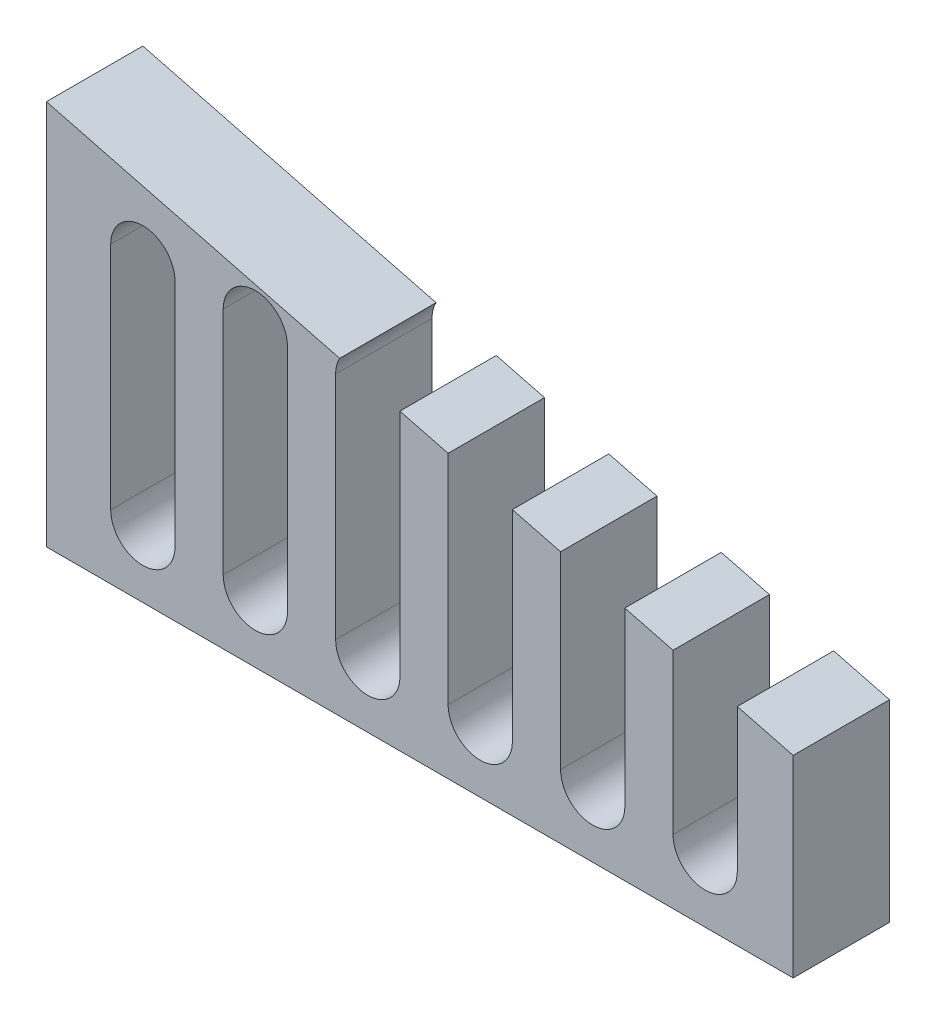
ISO-10303-21;
HEADER;
FILE_DESCRIPTION(('STEP AP214'),'2;1');
FILE_NAME('part.step','',(''),(''),'','','');
FILE_SCHEMA(('AUTOMOTIVE_DESIGN { 1 0 10303 214 1 1 1 1 }'));
ENDSEC;
DATA;
#1=APPLICATION_CONTEXT('core data for automotive mechanical design processes');
#2=APPLICATION_PROTOCOL_DEFINITION('international standard','automotive_design',2000,#1);
#3=PRODUCT_CONTEXT('',#1,'mechanical');
#4=PRODUCT('Part','Part','',(#3));
#5=PRODUCT_RELATED_PRODUCT_CATEGORY('part','',(#4));
#6=PRODUCT_DEFINITION_FORMATION('','',#4);
#7=PRODUCT_DEFINITION_CONTEXT('part definition',#1,'design');
#8=PRODUCT_DEFINITION('design','',#6,#7);
#9=PRODUCT_DEFINITION_SHAPE('','',#8);
#10=(LENGTH_UNIT() NAMED_UNIT(*) SI_UNIT(.MILLI.,.METRE.));
#11=(NAMED_UNIT(*) PLANE_ANGLE_UNIT() SI_UNIT($,.RADIAN.));
#12=(NAMED_UNIT(*) SI_UNIT($,.STERADIAN.) SOLID_ANGLE_UNIT());
#13=UNCERTAINTY_MEASURE_WITH_UNIT(LENGTH_MEASURE(1.E-05),#10,'distance_accuracy_value','');
#14=(GEOMETRIC_REPRESENTATION_CONTEXT(3) GLOBAL_UNCERTAINTY_ASSIGNED_CONTEXT((#13)) GLOBAL_UNIT_ASSIGNED_CONTEXT((#10,
#11,#12)) REPRESENTATION_CONTEXT('',''));
#15=CARTESIAN_POINT('',(0.,0.,0.));
#16=DIRECTION('',(0.,0.,1.));
#17=DIRECTION('',(1.,0.,0.));
#18=AXIS2_PLACEMENT_3D('',#15,#16,#17);
#19=CARTESIAN_POINT('',(0.,38.1,-9.525));
#20=DIRECTION('',(-0.25,-0.968245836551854,0.));
#21=DIRECTION('',(0.968245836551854,-0.25,0.));
#22=AXIS2_PLACEMENT_3D('',#19,#20,#21);
#23=PLANE('',#22);
#24=DIRECTION('',(0.968245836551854,-0.25,0.));
#25=VECTOR('',#24,1.);
#26=CARTESIAN_POINT('',(0.,38.1,-9.525));
#27=LINE('',#26,#25);
#28=CARTESIAN_POINT('',(68.2625,20.4746982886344,-9.525));
#29=VERTEX_POINT('',#28);
#30=CARTESIAN_POINT('',(73.7803327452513,19.05,-9.525));
#31=VERTEX_POINT('',#30);
#32=EDGE_CURVE('E410',#29,#31,#27,.T.);
#33=ORIENTED_EDGE('',*,*,#32,.F.);
#34=DIRECTION('',(0.,0.,1.));
#35=VECTOR('',#34,1.);
#36=CARTESIAN_POINT('',(68.2625,20.4746982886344,-9.525));
#37=LINE('',#36,#35);
#38=CARTESIAN_POINT('',(68.2625,20.4746982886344,0.));
#39=VERTEX_POINT('',#38);
#40=EDGE_CURVE('E249',#29,#39,#37,.T.);
#41=ORIENTED_EDGE('',*,*,#40,.T.);
#42=DIRECTION('',(0.968245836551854,-0.25,0.));
#43=VECTOR('',#42,1.);
#44=CARTESIAN_POINT('',(0.,38.1,0.));
#45=LINE('',#44,#43);
#46=CARTESIAN_POINT('',(73.7803327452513,19.05,0.));
#47=VERTEX_POINT('',#46);
#48=EDGE_CURVE('E398',#39,#47,#45,.T.);
#49=ORIENTED_EDGE('',*,*,#48,.T.);
#50=DIRECTION('',(0.,0.,1.));
#51=VECTOR('',#50,1.);
#52=CARTESIAN_POINT('',(73.7803327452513,19.05,-9.525));
#53=LINE('',#52,#51);
#54=EDGE_CURVE('E425',#31,#47,#53,.T.);
#55=ORIENTED_EDGE('',*,*,#54,.F.);
#56=EDGE_LOOP('',(#33,#41,#49,#55));
#57=FACE_BOUND('',#56,.T.);
#58=ADVANCED_FACE('F28',(#57),#23,.F.);
#59=CARTESIAN_POINT('',(57.15,23.3439334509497,0.));
#60=VERTEX_POINT('',#59);
#61=CARTESIAN_POINT('',(61.9125,22.1142612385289,0.));
#62=VERTEX_POINT('',#61);
#63=EDGE_CURVE('E441',#60,#62,#45,.T.);
#64=ORIENTED_EDGE('',*,*,#63,.T.);
#65=DIRECTION('',(0.,0.,-1.));
#66=VECTOR('',#65,1.);
#67=CARTESIAN_POINT('',(61.9125,22.1142612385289,-9.525));
#68=LINE('',#67,#66);
#69=CARTESIAN_POINT('',(61.9125,22.1142612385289,-9.525));
#70=VERTEX_POINT('',#69);
#71=EDGE_CURVE('E43',#62,#70,#68,.T.);
#72=ORIENTED_EDGE('',*,*,#71,.T.);
#73=CARTESIAN_POINT('',(57.15,23.3439334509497,-9.525));
#74=VERTEX_POINT('',#73);
#75=EDGE_CURVE('E239',#74,#70,#27,.T.);
#76=ORIENTED_EDGE('',*,*,#75,.F.);
#77=DIRECTION('',(0.,0.,1.));
#78=VECTOR('',#77,1.);
#79=CARTESIAN_POINT('',(57.15,23.3439334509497,-9.525));
#80=LINE('',#79,#78);
#81=EDGE_CURVE('E270',#74,#60,#80,.T.);
#82=ORIENTED_EDGE('',*,*,#81,.T.);
#83=EDGE_LOOP('',(#64,#72,#76,#82));
#84=FACE_BOUND('',#83,.T.);
#85=ADVANCED_FACE('F440',(#84),#23,.F.);
#86=CARTESIAN_POINT('',(46.0375,26.2131686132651,0.));
#87=VERTEX_POINT('',#86);
#88=CARTESIAN_POINT('',(50.8,24.9834964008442,0.));
#89=VERTEX_POINT('',#88);
#90=EDGE_CURVE('E445',#87,#89,#45,.T.);
#91=ORIENTED_EDGE('',*,*,#90,.T.);
#92=DIRECTION('',(0.,0.,-1.));
#93=VECTOR('',#92,1.);
#94=CARTESIAN_POINT('',(50.8,24.9834964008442,-9.525));
#95=LINE('',#94,#93);
#96=CARTESIAN_POINT('',(50.8,24.9834964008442,-9.525));
#97=VERTEX_POINT('',#96);
#98=EDGE_CURVE('E51',#89,#97,#95,.T.);
#99=ORIENTED_EDGE('',*,*,#98,.T.);
#100=CARTESIAN_POINT('',(46.0375,26.2131686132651,-9.525));
#101=VERTEX_POINT('',#100);
#102=EDGE_CURVE('E466',#101,#97,#27,.T.);
#103=ORIENTED_EDGE('',*,*,#102,.F.);
#104=DIRECTION('',(0.,0.,1.));
#105=VECTOR('',#104,1.);
#106=CARTESIAN_POINT('',(46.0375,26.2131686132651,-9.525));
#107=LINE('',#106,#105);
#108=EDGE_CURVE('E294',#101,#87,#107,.T.);
#109=ORIENTED_EDGE('',*,*,#108,.T.);
#110=EDGE_LOOP('',(#91,#99,#103,#109));
#111=FACE_BOUND('',#110,.T.);
#112=ADVANCED_FACE('F492',(#111),#23,.F.);
#113=CARTESIAN_POINT('',(0.,38.1,0.));
#114=VERTEX_POINT('',#113);
#115=CARTESIAN_POINT('',(28.971875,30.6194940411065,0.));
#116=VERTEX_POINT('',#115);
#117=EDGE_CURVE('E399',#114,#116,#45,.T.);
#118=ORIENTED_EDGE('',*,*,#117,.T.);
#119=DIRECTION('',(0.,0.,-1.));
#120=VECTOR('',#119,1.);
#121=CARTESIAN_POINT('',(28.971875,30.6194940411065,0.));
#122=LINE('',#121,#120);
#123=CARTESIAN_POINT('',(28.971875,30.6194940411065,-9.525));
#124=VERTEX_POINT('',#123);
#125=EDGE_CURVE('E323',#116,#124,#122,.T.);
#126=ORIENTED_EDGE('',*,*,#125,.T.);
#127=CARTESIAN_POINT('',(0.,38.1,-9.525));
#128=VERTEX_POINT('',#127);
#129=EDGE_CURVE('E411',#128,#124,#27,.T.);
#130=ORIENTED_EDGE('',*,*,#129,.F.);
#131=DIRECTION('',(0.,0.,1.));
#132=VECTOR('',#131,1.);
#133=CARTESIAN_POINT('',(0.,38.1,-9.525));
#134=LINE('',#133,#132);
#135=EDGE_CURVE('E428',#128,#114,#134,.T.);
#136=ORIENTED_EDGE('',*,*,#135,.T.);
#137=EDGE_LOOP('',(#118,#126,#130,#136));
#138=FACE_BOUND('',#137,.T.);
#139=ADVANCED_FACE('F515',(#138),#23,.F.);
#140=CARTESIAN_POINT('',(0.,38.1,-9.525));
#141=DIRECTION('',(1.,0.,0.));
#142=DIRECTION('',(0.,0.,-1.));
#143=AXIS2_PLACEMENT_3D('',#140,#141,#142);
#144=PLANE('',#143);
#145=DIRECTION('',(0.,1.,0.));
#146=VECTOR('',#145,1.);
#147=CARTESIAN_POINT('',(0.,38.1,0.));
#148=LINE('',#147,#146);
#149=CARTESIAN_POINT('',(0.,0.,0.));
#150=VERTEX_POINT('',#149);
#151=EDGE_CURVE('E389',#150,#114,#148,.T.);
#152=ORIENTED_EDGE('',*,*,#151,.T.);
#153=ORIENTED_EDGE('',*,*,#135,.F.);
#154=DIRECTION('',(0.,1.,0.));
#155=VECTOR('',#154,1.);
#156=CARTESIAN_POINT('',(0.,38.1,-9.525));
#157=LINE('',#156,#155);
#158=CARTESIAN_POINT('',(0.,0.,-9.525));
#159=VERTEX_POINT('',#158);
#160=EDGE_CURVE('E407',#159,#128,#157,.T.);
#161=ORIENTED_EDGE('',*,*,#160,.F.);
#162=DIRECTION('',(0.,0.,1.));
#163=VECTOR('',#162,1.);
#164=CARTESIAN_POINT('',(0.,0.,-9.525));
#165=LINE('',#164,#163);
#166=EDGE_CURVE('E419',#159,#150,#165,.T.);
#167=ORIENTED_EDGE('',*,*,#166,.T.);
#168=EDGE_LOOP('',(#152,#153,#161,#167));
#169=FACE_BOUND('',#168,.T.);
#170=ADVANCED_FACE('F30',(#169),#144,.F.);
#171=CARTESIAN_POINT('',(34.925,29.0824037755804,0.));
#172=VERTEX_POINT('',#171);
#173=CARTESIAN_POINT('',(39.6875,27.8527315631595,0.));
#174=VERTEX_POINT('',#173);
#175=EDGE_CURVE('E403',#172,#174,#45,.T.);
#176=ORIENTED_EDGE('',*,*,#175,.T.);
#177=DIRECTION('',(0.,0.,-1.));
#178=VECTOR('',#177,1.);
#179=CARTESIAN_POINT('',(39.6875,27.8527315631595,-9.525));
#180=LINE('',#179,#178);
#181=CARTESIAN_POINT('',(39.6875,27.8527315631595,-9.525));
#182=VERTEX_POINT('',#181);
#183=EDGE_CURVE('E290',#174,#182,#180,.T.);
#184=ORIENTED_EDGE('',*,*,#183,.T.);
#185=CARTESIAN_POINT('',(34.925,29.0824037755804,-9.525));
#186=VERTEX_POINT('',#185);
#187=EDGE_CURVE('E415',#186,#182,#27,.T.);
#188=ORIENTED_EDGE('',*,*,#187,.F.);
#189=DIRECTION('',(0.,0.,-1.));
#190=VECTOR('',#189,1.);
#191=CARTESIAN_POINT('',(34.925,29.0824037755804,0.));
#192=LINE('',#191,#190);
#193=EDGE_CURVE('E324',#172,#186,#192,.T.);
#194=ORIENTED_EDGE('',*,*,#193,.F.);
#195=EDGE_LOOP('',(#176,#184,#188,#194));
#196=FACE_BOUND('',#195,.T.);
#197=ADVANCED_FACE('F480',(#196),#23,.F.);
#198=CARTESIAN_POINT('',(73.7803327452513,19.05,-9.525));
#199=DIRECTION('',(-1.,0.,0.));
#200=DIRECTION('',(0.,0.,1.));
#201=AXIS2_PLACEMENT_3D('',#198,#199,#200);
#202=PLANE('',#201);
#203=DIRECTION('',(0.,-1.,0.));
#204=VECTOR('',#203,1.);
#205=CARTESIAN_POINT('',(73.7803327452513,19.05,0.));
#206=LINE('',#205,#204);
#207=CARTESIAN_POINT('',(73.7803327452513,0.,0.));
#208=VERTEX_POINT('',#207);
#209=EDGE_CURVE('E402',#47,#208,#206,.T.);
#210=ORIENTED_EDGE('',*,*,#209,.T.);
#211=DIRECTION('',(0.,0.,1.));
#212=VECTOR('',#211,1.);
#213=CARTESIAN_POINT('',(73.7803327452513,0.,-9.525));
#214=LINE('',#213,#212);
#215=CARTESIAN_POINT('',(73.7803327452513,0.,-9.525));
#216=VERTEX_POINT('',#215);
#217=EDGE_CURVE('E422',#216,#208,#214,.T.);
#218=ORIENTED_EDGE('',*,*,#217,.F.);
#219=DIRECTION('',(0.,-1.,0.));
#220=VECTOR('',#219,1.);
#221=CARTESIAN_POINT('',(73.7803327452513,19.05,-9.525));
#222=LINE('',#221,#220);
#223=EDGE_CURVE('E414',#31,#216,#222,.T.);
#224=ORIENTED_EDGE('',*,*,#223,.F.);
#225=ORIENTED_EDGE('',*,*,#54,.T.);
#226=EDGE_LOOP('',(#210,#218,#224,#225));
#227=FACE_BOUND('',#226,.T.);
#228=ADVANCED_FACE('F454',(#227),#202,.F.);
#229=CARTESIAN_POINT('',(0.,0.,-9.525));
#230=DIRECTION('',(0.,1.,0.));
#231=DIRECTION('',(0.,0.,1.));
#232=AXIS2_PLACEMENT_3D('',#229,#230,#231);
#233=PLANE('',#232);
#234=DIRECTION('',(-1.,0.,0.));
#235=VECTOR('',#234,1.);
#236=CARTESIAN_POINT('',(0.,0.,0.));
#237=LINE('',#236,#235);
#238=EDGE_CURVE('E405',#208,#150,#237,.T.);
#239=ORIENTED_EDGE('',*,*,#238,.T.);
#240=ORIENTED_EDGE('',*,*,#166,.F.);
#241=DIRECTION('',(-1.,0.,0.));
#242=VECTOR('',#241,1.);
#243=CARTESIAN_POINT('',(0.,0.,-9.525));
#244=LINE('',#243,#242);
#245=EDGE_CURVE('E417',#216,#159,#244,.T.);
#246=ORIENTED_EDGE('',*,*,#245,.F.);
#247=ORIENTED_EDGE('',*,*,#217,.T.);
#248=EDGE_LOOP('',(#239,#240,#246,#247));
#249=FACE_BOUND('',#248,.T.);
#250=ADVANCED_FACE('F460',(#249),#233,.F.);
#251=CARTESIAN_POINT('',(0.,0.,-9.525));
#252=DIRECTION('',(0.,0.,1.));
#253=DIRECTION('',(1.,0.,0.));
#254=AXIS2_PLACEMENT_3D('',#251,#252,#253);
#255=PLANE('',#254);
#256=DIRECTION('',(0.,1.,0.));
#257=VECTOR('',#256,1.);
#258=CARTESIAN_POINT('',(17.4625,6.34999999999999,-9.525));
#259=LINE('',#258,#257);
#260=CARTESIAN_POINT('',(17.4625,6.34999999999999,-9.525));
#261=VERTEX_POINT('',#260);
#262=CARTESIAN_POINT('',(17.4625,29.0824037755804,-9.525));
#263=VERTEX_POINT('',#262);
#264=EDGE_CURVE('E333',#261,#263,#259,.T.);
#265=ORIENTED_EDGE('',*,*,#264,.F.);
#266=CARTESIAN_POINT('',(20.6375,6.35,-9.525));
#267=DIRECTION('',(0.,0.,-1.));
#268=DIRECTION('',(0.,-1.,0.));
#269=AXIS2_PLACEMENT_3D('',#266,#267,#268);
#270=CIRCLE('',#269,3.175);
#271=CARTESIAN_POINT('',(23.8125,6.34999999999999,-9.525));
#272=VERTEX_POINT('',#271);
#273=EDGE_CURVE('E331',#272,#261,#270,.T.);
#274=ORIENTED_EDGE('',*,*,#273,.F.);
#275=DIRECTION('',(0.,-1.,0.));
#276=VECTOR('',#275,1.);
#277=CARTESIAN_POINT('',(23.8125,6.34999999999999,-9.525));
#278=LINE('',#277,#276);
#279=CARTESIAN_POINT('',(23.8125,29.0824037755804,-9.525));
#280=VERTEX_POINT('',#279);
#281=EDGE_CURVE('E339',#280,#272,#278,.T.);
#282=ORIENTED_EDGE('',*,*,#281,.F.);
#283=CARTESIAN_POINT('',(20.6375,29.0824037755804,-9.525));
#284=DIRECTION('',(0.,0.,-1.));
#285=DIRECTION('',(0.,-1.,0.));
#286=AXIS2_PLACEMENT_3D('',#283,#284,#285);
#287=CIRCLE('',#286,3.175);
#288=EDGE_CURVE('E336',#263,#280,#287,.T.);
#289=ORIENTED_EDGE('',*,*,#288,.F.);
#290=EDGE_LOOP('',(#265,#274,#282,#289));
#291=FACE_BOUND('',#290,.T.);
#292=DIRECTION('',(0.,1.,0.));
#293=VECTOR('',#292,1.);
#294=CARTESIAN_POINT('',(6.35,6.34999999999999,-9.525));
#295=LINE('',#294,#293);
#296=CARTESIAN_POINT('',(6.35,6.34999999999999,-9.525));
#297=VERTEX_POINT('',#296);
#298=CARTESIAN_POINT('',(6.35,29.0824037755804,-9.525));
#299=VERTEX_POINT('',#298);
#300=EDGE_CURVE('E365',#297,#299,#295,.T.);
#301=ORIENTED_EDGE('',*,*,#300,.F.);
#302=CARTESIAN_POINT('',(9.525,6.35,-9.525));
#303=DIRECTION('',(0.,0.,-1.));
#304=DIRECTION('',(0.,-1.,0.));
#305=AXIS2_PLACEMENT_3D('',#302,#303,#304);
#306=CIRCLE('',#305,3.175);
#307=CARTESIAN_POINT('',(12.7,6.34999999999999,-9.525));
#308=VERTEX_POINT('',#307);
#309=EDGE_CURVE('E357',#308,#297,#306,.T.);
#310=ORIENTED_EDGE('',*,*,#309,.F.);
#311=DIRECTION('',(0.,-1.,0.));
#312=VECTOR('',#311,1.);
#313=CARTESIAN_POINT('',(12.7,6.34999999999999,-9.525));
#314=LINE('',#313,#312);
#315=CARTESIAN_POINT('',(12.7,29.0824037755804,-9.525));
#316=VERTEX_POINT('',#315);
#317=EDGE_CURVE('E371',#316,#308,#314,.T.);
#318=ORIENTED_EDGE('',*,*,#317,.F.);
#319=CARTESIAN_POINT('',(9.525,29.0824037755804,-9.525));
#320=DIRECTION('',(0.,0.,-1.));
#321=DIRECTION('',(0.,-1.,0.));
#322=AXIS2_PLACEMENT_3D('',#319,#320,#321);
#323=CIRCLE('',#322,3.175);
#324=EDGE_CURVE('E368',#299,#316,#323,.T.);
#325=ORIENTED_EDGE('',*,*,#324,.F.);
#326=EDGE_LOOP('',(#301,#310,#318,#325));
#327=FACE_BOUND('',#326,.T.);
#328=CARTESIAN_POINT('',(65.0875,6.35,-9.525));
#329=DIRECTION('',(0.,0.,-1.));
#330=DIRECTION('',(0.,-1.,0.));
#331=AXIS2_PLACEMENT_3D('',#328,#329,#330);
#332=CIRCLE('',#331,3.175);
#333=CARTESIAN_POINT('',(68.2625,6.34999999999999,-9.525));
#334=VERTEX_POINT('',#333);
#335=CARTESIAN_POINT('',(61.9125,6.34999999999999,-9.525));
#336=VERTEX_POINT('',#335);
#337=EDGE_CURVE('E230',#334,#336,#332,.T.);
#338=ORIENTED_EDGE('',*,*,#337,.F.);
#339=DIRECTION('',(0.,-1.,0.));
#340=VECTOR('',#339,1.);
#341=CARTESIAN_POINT('',(68.2625,6.34999999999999,-9.525));
#342=LINE('',#341,#340);
#343=EDGE_CURVE('E240',#29,#334,#342,.T.);
#344=ORIENTED_EDGE('',*,*,#343,.F.);
#345=ORIENTED_EDGE('',*,*,#32,.T.);
#346=ORIENTED_EDGE('',*,*,#223,.T.);
#347=ORIENTED_EDGE('',*,*,#245,.T.);
#348=ORIENTED_EDGE('',*,*,#160,.T.);
#349=ORIENTED_EDGE('',*,*,#129,.T.);
#350=CARTESIAN_POINT('',(31.75,29.0824037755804,-9.525));
#351=DIRECTION('',(0.,0.,-1.));
#352=DIRECTION('',(0.,-1.,0.));
#353=AXIS2_PLACEMENT_3D('',#350,#351,#352);
#354=CIRCLE('',#353,3.175);
#355=CARTESIAN_POINT('',(28.575,29.0824037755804,-9.525));
#356=VERTEX_POINT('',#355);
#357=EDGE_CURVE('E303',#356,#124,#354,.T.);
#358=ORIENTED_EDGE('',*,*,#357,.F.);
#359=DIRECTION('',(0.,1.,0.));
#360=VECTOR('',#359,1.);
#361=CARTESIAN_POINT('',(28.575,6.34999999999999,-9.525));
#362=LINE('',#361,#360);
#363=CARTESIAN_POINT('',(28.575,6.34999999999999,-9.525));
#364=VERTEX_POINT('',#363);
#365=EDGE_CURVE('E300',#364,#356,#362,.T.);
#366=ORIENTED_EDGE('',*,*,#365,.F.);
#367=CARTESIAN_POINT('',(31.75,6.35,-9.525));
#368=DIRECTION('',(0.,0.,-1.));
#369=DIRECTION('',(0.,-1.,0.));
#370=AXIS2_PLACEMENT_3D('',#367,#368,#369);
#371=CIRCLE('',#370,3.175);
#372=CARTESIAN_POINT('',(34.925,6.34999999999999,-9.525));
#373=VERTEX_POINT('',#372);
#374=EDGE_CURVE('E297',#373,#364,#371,.T.);
#375=ORIENTED_EDGE('',*,*,#374,.F.);
#376=DIRECTION('',(0.,-1.,0.));
#377=VECTOR('',#376,1.);
#378=CARTESIAN_POINT('',(34.925,6.34999999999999,-9.525));
#379=LINE('',#378,#377);
#380=EDGE_CURVE('E305',#186,#373,#379,.T.);
#381=ORIENTED_EDGE('',*,*,#380,.F.);
#382=ORIENTED_EDGE('',*,*,#187,.T.);
#383=DIRECTION('',(0.,1.,0.));
#384=VECTOR('',#383,1.);
#385=CARTESIAN_POINT('',(39.6875,6.34999999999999,-9.525));
#386=LINE('',#385,#384);
#387=CARTESIAN_POINT('',(39.6875,6.34999999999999,-9.525));
#388=VERTEX_POINT('',#387);
#389=EDGE_CURVE('E276',#388,#182,#386,.T.);
#390=ORIENTED_EDGE('',*,*,#389,.F.);
#391=CARTESIAN_POINT('',(42.8625,6.35,-9.525));
#392=DIRECTION('',(0.,0.,-1.));
#393=DIRECTION('',(0.,-1.,0.));
#394=AXIS2_PLACEMENT_3D('',#391,#392,#393);
#395=CIRCLE('',#394,3.175);
#396=CARTESIAN_POINT('',(46.0375,6.34999999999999,-9.525));
#397=VERTEX_POINT('',#396);
#398=EDGE_CURVE('E273',#397,#388,#395,.T.);
#399=ORIENTED_EDGE('',*,*,#398,.F.);
#400=DIRECTION('',(0.,-1.,0.));
#401=VECTOR('',#400,1.);
#402=CARTESIAN_POINT('',(46.0375,6.34999999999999,-9.525));
#403=LINE('',#402,#401);
#404=EDGE_CURVE('E278',#101,#397,#403,.T.);
#405=ORIENTED_EDGE('',*,*,#404,.F.);
#406=ORIENTED_EDGE('',*,*,#102,.T.);
#407=DIRECTION('',(0.,1.,0.));
#408=VECTOR('',#407,1.);
#409=CARTESIAN_POINT('',(50.8,6.34999999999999,-9.525));
#410=LINE('',#409,#408);
#411=CARTESIAN_POINT('',(50.8,6.34999999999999,-9.525));
#412=VERTEX_POINT('',#411);
#413=EDGE_CURVE('E255',#412,#97,#410,.T.);
#414=ORIENTED_EDGE('',*,*,#413,.F.);
#415=CARTESIAN_POINT('',(53.975,6.35,-9.525));
#416=DIRECTION('',(0.,0.,-1.));
#417=DIRECTION('',(0.,-1.,0.));
#418=AXIS2_PLACEMENT_3D('',#415,#416,#417);
#419=CIRCLE('',#418,3.175);
#420=CARTESIAN_POINT('',(57.15,6.34999999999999,-9.525));
#421=VERTEX_POINT('',#420);
#422=EDGE_CURVE('E252',#421,#412,#419,.T.);
#423=ORIENTED_EDGE('',*,*,#422,.F.);
#424=DIRECTION('',(0.,-1.,0.));
#425=VECTOR('',#424,1.);
#426=CARTESIAN_POINT('',(57.15,6.34999999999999,-9.525));
#427=LINE('',#426,#425);
#428=EDGE_CURVE('E257',#74,#421,#427,.T.);
#429=ORIENTED_EDGE('',*,*,#428,.F.);
#430=ORIENTED_EDGE('',*,*,#75,.T.);
#431=DIRECTION('',(0.,1.,0.));
#432=VECTOR('',#431,1.);
#433=CARTESIAN_POINT('',(61.9125,6.34999999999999,-9.525));
#434=LINE('',#433,#432);
#435=EDGE_CURVE('E221',#336,#70,#434,.T.);
#436=ORIENTED_EDGE('',*,*,#435,.F.);
#437=EDGE_LOOP('',(#338,#344,#345,#346,#347,#348,#349,#358,#366,#375,#381,#382,#390,#399,#405,
#406,#414,#423,#429,#430,#436));
#438=FACE_BOUND('',#437,.T.);
#439=ADVANCED_FACE('F236',(#291,#327,#438),#255,.F.);
#440=CARTESIAN_POINT('',(0.,0.,0.));
#441=DIRECTION('',(0.,0.,1.));
#442=DIRECTION('',(1.,0.,0.));
#443=AXIS2_PLACEMENT_3D('',#440,#441,#442);
#444=PLANE('',#443);
#445=DIRECTION('',(0.,1.,0.));
#446=VECTOR('',#445,1.);
#447=CARTESIAN_POINT('',(68.2625,0.,0.));
#448=LINE('',#447,#446);
#449=CARTESIAN_POINT('',(68.2625,6.35,0.));
#450=VERTEX_POINT('',#449);
#451=EDGE_CURVE('E11',#450,#39,#448,.T.);
#452=ORIENTED_EDGE('',*,*,#451,.F.);
#453=CARTESIAN_POINT('',(65.0875,6.35,0.));
#454=DIRECTION('',(0.,0.,-1.));
#455=DIRECTION('',(0.,-1.,0.));
#456=AXIS2_PLACEMENT_3D('',#453,#454,#455);
#457=CIRCLE('',#456,3.175);
#458=CARTESIAN_POINT('',(61.9125,6.35,0.));
#459=VERTEX_POINT('',#458);
#460=EDGE_CURVE('E242',#450,#459,#457,.T.);
#461=ORIENTED_EDGE('',*,*,#460,.T.);
#462=DIRECTION('',(0.,1.,0.));
#463=VECTOR('',#462,1.);
#464=CARTESIAN_POINT('',(61.9125,6.35,0.));
#465=LINE('',#464,#463);
#466=EDGE_CURVE('E222',#459,#62,#465,.T.);
#467=ORIENTED_EDGE('',*,*,#466,.T.);
#468=ORIENTED_EDGE('',*,*,#63,.F.);
#469=DIRECTION('',(0.,1.,0.));
#470=VECTOR('',#469,1.);
#471=CARTESIAN_POINT('',(57.15,0.,0.));
#472=LINE('',#471,#470);
#473=CARTESIAN_POINT('',(57.15,6.35,0.));
#474=VERTEX_POINT('',#473);
#475=EDGE_CURVE('E36',#474,#60,#472,.T.);
#476=ORIENTED_EDGE('',*,*,#475,.F.);
#477=CARTESIAN_POINT('',(53.975,6.35,0.));
#478=DIRECTION('',(0.,0.,-1.));
#479=DIRECTION('',(0.,-1.,0.));
#480=AXIS2_PLACEMENT_3D('',#477,#478,#479);
#481=CIRCLE('',#480,3.175);
#482=CARTESIAN_POINT('',(50.8,6.35,0.));
#483=VERTEX_POINT('',#482);
#484=EDGE_CURVE('E259',#474,#483,#481,.T.);
#485=ORIENTED_EDGE('',*,*,#484,.T.);
#486=DIRECTION('',(0.,1.,0.));
#487=VECTOR('',#486,1.);
#488=CARTESIAN_POINT('',(50.8,6.35,0.));
#489=LINE('',#488,#487);
#490=EDGE_CURVE('E262',#483,#89,#489,.T.);
#491=ORIENTED_EDGE('',*,*,#490,.T.);
#492=ORIENTED_EDGE('',*,*,#90,.F.);
#493=DIRECTION('',(0.,1.,0.));
#494=VECTOR('',#493,1.);
#495=CARTESIAN_POINT('',(46.0375,0.,0.));
#496=LINE('',#495,#494);
#497=CARTESIAN_POINT('',(46.0375,6.35,0.));
#498=VERTEX_POINT('',#497);
#499=EDGE_CURVE('E431',#498,#87,#496,.T.);
#500=ORIENTED_EDGE('',*,*,#499,.F.);
#501=CARTESIAN_POINT('',(42.8625,6.35,0.));
#502=DIRECTION('',(0.,0.,-1.));
#503=DIRECTION('',(0.,-1.,0.));
#504=AXIS2_PLACEMENT_3D('',#501,#502,#503);
#505=CIRCLE('',#504,3.175);
#506=CARTESIAN_POINT('',(39.6875,6.35,0.));
#507=VERTEX_POINT('',#506);
#508=EDGE_CURVE('E280',#498,#507,#505,.T.);
#509=ORIENTED_EDGE('',*,*,#508,.T.);
#510=DIRECTION('',(0.,1.,0.));
#511=VECTOR('',#510,1.);
#512=CARTESIAN_POINT('',(39.6875,6.35,0.));
#513=LINE('',#512,#511);
#514=EDGE_CURVE('E283',#507,#174,#513,.T.);
#515=ORIENTED_EDGE('',*,*,#514,.T.);
#516=ORIENTED_EDGE('',*,*,#175,.F.);
#517=DIRECTION('',(0.,-1.,0.));
#518=VECTOR('',#517,1.);
#519=CARTESIAN_POINT('',(34.925,6.35,0.));
#520=LINE('',#519,#518);
#521=CARTESIAN_POINT('',(34.925,6.35,0.));
#522=VERTEX_POINT('',#521);
#523=EDGE_CURVE('E317',#172,#522,#520,.T.);
#524=ORIENTED_EDGE('',*,*,#523,.T.);
#525=CARTESIAN_POINT('',(31.75,6.35,0.));
#526=DIRECTION('',(0.,0.,-1.));
#527=DIRECTION('',(0.,-1.,0.));
#528=AXIS2_PLACEMENT_3D('',#525,#526,#527);
#529=CIRCLE('',#528,3.175);
#530=CARTESIAN_POINT('',(28.575,6.35,0.));
#531=VERTEX_POINT('',#530);
#532=EDGE_CURVE('E308',#522,#531,#529,.T.);
#533=ORIENTED_EDGE('',*,*,#532,.T.);
#534=DIRECTION('',(0.,1.,0.));
#535=VECTOR('',#534,1.);
#536=CARTESIAN_POINT('',(28.575,6.35,0.));
#537=LINE('',#536,#535);
#538=CARTESIAN_POINT('',(28.575,29.0824037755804,0.));
#539=VERTEX_POINT('',#538);
#540=EDGE_CURVE('E311',#531,#539,#537,.T.);
#541=ORIENTED_EDGE('',*,*,#540,.T.);
#542=CARTESIAN_POINT('',(31.75,29.0824037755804,0.));
#543=DIRECTION('',(0.,0.,-1.));
#544=DIRECTION('',(0.,-1.,0.));
#545=AXIS2_PLACEMENT_3D('',#542,#543,#544);
#546=CIRCLE('',#545,3.175);
#547=EDGE_CURVE('E314',#539,#116,#546,.T.);
#548=ORIENTED_EDGE('',*,*,#547,.T.);
#549=ORIENTED_EDGE('',*,*,#117,.F.);
#550=ORIENTED_EDGE('',*,*,#151,.F.);
#551=ORIENTED_EDGE('',*,*,#238,.F.);
#552=ORIENTED_EDGE('',*,*,#209,.F.);
#553=ORIENTED_EDGE('',*,*,#48,.F.);
#554=EDGE_LOOP('',(#452,#461,#467,#468,#476,#485,#491,#492,#500,#509,#515,#516,#524,#533,#541,
#548,#549,#550,#551,#552,#553));
#555=FACE_BOUND('',#554,.T.);
#556=CARTESIAN_POINT('',(20.6375,6.35,0.));
#557=DIRECTION('',(0.,0.,-1.));
#558=DIRECTION('',(0.,-1.,0.));
#559=AXIS2_PLACEMENT_3D('',#556,#557,#558);
#560=CIRCLE('',#559,3.175);
#561=CARTESIAN_POINT('',(23.8125,6.35,0.));
#562=VERTEX_POINT('',#561);
#563=CARTESIAN_POINT('',(17.4625,6.35,0.));
#564=VERTEX_POINT('',#563);
#565=EDGE_CURVE('E342',#562,#564,#560,.T.);
#566=ORIENTED_EDGE('',*,*,#565,.T.);
#567=DIRECTION('',(0.,1.,0.));
#568=VECTOR('',#567,1.);
#569=CARTESIAN_POINT('',(17.4625,6.35,0.));
#570=LINE('',#569,#568);
#571=CARTESIAN_POINT('',(17.4625,29.0824037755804,0.));
#572=VERTEX_POINT('',#571);
#573=EDGE_CURVE('E345',#564,#572,#570,.T.);
#574=ORIENTED_EDGE('',*,*,#573,.T.);
#575=CARTESIAN_POINT('',(20.6375,29.0824037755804,0.));
#576=DIRECTION('',(0.,0.,-1.));
#577=DIRECTION('',(0.,-1.,0.));
#578=AXIS2_PLACEMENT_3D('',#575,#576,#577);
#579=CIRCLE('',#578,3.175);
#580=CARTESIAN_POINT('',(23.8125,29.0824037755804,0.));
#581=VERTEX_POINT('',#580);
#582=EDGE_CURVE('E348',#572,#581,#579,.T.);
#583=ORIENTED_EDGE('',*,*,#582,.T.);
#584=DIRECTION('',(0.,-1.,0.));
#585=VECTOR('',#584,1.);
#586=CARTESIAN_POINT('',(23.8125,6.35,0.));
#587=LINE('',#586,#585);
#588=EDGE_CURVE('E351',#581,#562,#587,.T.);
#589=ORIENTED_EDGE('',*,*,#588,.T.);
#590=EDGE_LOOP('',(#566,#574,#583,#589));
#591=FACE_BOUND('',#590,.T.);
#592=CARTESIAN_POINT('',(9.525,6.35,0.));
#593=DIRECTION('',(0.,0.,-1.));
#594=DIRECTION('',(0.,-1.,0.));
#595=AXIS2_PLACEMENT_3D('',#592,#593,#594);
#596=CIRCLE('',#595,3.175);
#597=CARTESIAN_POINT('',(12.7,6.35,0.));
#598=VERTEX_POINT('',#597);
#599=CARTESIAN_POINT('',(6.35,6.35,0.));
#600=VERTEX_POINT('',#599);
#601=EDGE_CURVE('E374',#598,#600,#596,.T.);
#602=ORIENTED_EDGE('',*,*,#601,.T.);
#603=DIRECTION('',(0.,1.,0.));
#604=VECTOR('',#603,1.);
#605=CARTESIAN_POINT('',(6.35,6.35,0.));
#606=LINE('',#605,#604);
#607=CARTESIAN_POINT('',(6.35,29.0824037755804,0.));
#608=VERTEX_POINT('',#607);
#609=EDGE_CURVE('E377',#600,#608,#606,.T.);
#610=ORIENTED_EDGE('',*,*,#609,.T.);
#611=CARTESIAN_POINT('',(9.525,29.0824037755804,0.));
#612=DIRECTION('',(0.,0.,-1.));
#613=DIRECTION('',(0.,-1.,0.));
#614=AXIS2_PLACEMENT_3D('',#611,#612,#613);
#615=CIRCLE('',#614,3.175);
#616=CARTESIAN_POINT('',(12.7,29.0824037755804,0.));
#617=VERTEX_POINT('',#616);
#618=EDGE_CURVE('E380',#608,#617,#615,.T.);
#619=ORIENTED_EDGE('',*,*,#618,.T.);
#620=DIRECTION('',(0.,-1.,0.));
#621=VECTOR('',#620,1.);
#622=CARTESIAN_POINT('',(12.7,6.35,0.));
#623=LINE('',#622,#621);
#624=EDGE_CURVE('E383',#617,#598,#623,.T.);
#625=ORIENTED_EDGE('',*,*,#624,.T.);
#626=EDGE_LOOP('',(#602,#610,#619,#625));
#627=FACE_BOUND('',#626,.T.);
#628=ADVANCED_FACE('F443',(#555,#591,#627),#444,.T.);
#629=CARTESIAN_POINT('',(9.525,6.35,0.));
#630=DIRECTION('',(0.,0.,-1.));
#631=DIRECTION('',(0.,1.,0.));
#632=AXIS2_PLACEMENT_3D('',#629,#630,#631);
#633=CYLINDRICAL_SURFACE('',#632,3.175);
#634=ORIENTED_EDGE('',*,*,#309,.T.);
#635=DIRECTION('',(0.,0.,-1.));
#636=VECTOR('',#635,1.);
#637=CARTESIAN_POINT('',(6.35,6.35,0.));
#638=LINE('',#637,#636);
#639=EDGE_CURVE('E386',#600,#297,#638,.T.);
#640=ORIENTED_EDGE('',*,*,#639,.F.);
#641=ORIENTED_EDGE('',*,*,#601,.F.);
#642=DIRECTION('',(0.,0.,-1.));
#643=VECTOR('',#642,1.);
#644=CARTESIAN_POINT('',(12.7,6.35,0.));
#645=LINE('',#644,#643);
#646=EDGE_CURVE('E387',#598,#308,#645,.T.);
#647=ORIENTED_EDGE('',*,*,#646,.T.);
#648=EDGE_LOOP('',(#634,#640,#641,#647));
#649=FACE_BOUND('',#648,.T.);
#650=ADVANCED_FACE('F573',(#649),#633,.F.);
#651=CARTESIAN_POINT('',(12.7,6.35,0.));
#652=DIRECTION('',(1.,0.,0.));
#653=DIRECTION('',(0.,1.,0.));
#654=AXIS2_PLACEMENT_3D('',#651,#652,#653);
#655=PLANE('',#654);
#656=ORIENTED_EDGE('',*,*,#317,.T.);
#657=ORIENTED_EDGE('',*,*,#646,.F.);
#658=ORIENTED_EDGE('',*,*,#624,.F.);
#659=DIRECTION('',(0.,0.,-1.));
#660=VECTOR('',#659,1.);
#661=CARTESIAN_POINT('',(12.7,29.0824037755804,0.));
#662=LINE('',#661,#660);
#663=EDGE_CURVE('E390',#617,#316,#662,.T.);
#664=ORIENTED_EDGE('',*,*,#663,.T.);
#665=EDGE_LOOP('',(#656,#657,#658,#664));
#666=FACE_BOUND('',#665,.T.);
#667=ADVANCED_FACE('F569',(#666),#655,.F.);
#668=CARTESIAN_POINT('',(9.525,29.0824037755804,0.));
#669=DIRECTION('',(0.,0.,-1.));
#670=DIRECTION('',(0.,1.,0.));
#671=AXIS2_PLACEMENT_3D('',#668,#669,#670);
#672=CYLINDRICAL_SURFACE('',#671,3.175);
#673=ORIENTED_EDGE('',*,*,#324,.T.);
#674=ORIENTED_EDGE('',*,*,#663,.F.);
#675=ORIENTED_EDGE('',*,*,#618,.F.);
#676=DIRECTION('',(0.,0.,-1.));
#677=VECTOR('',#676,1.);
#678=CARTESIAN_POINT('',(6.35,29.0824037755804,0.));
#679=LINE('',#678,#677);
#680=EDGE_CURVE('E392',#608,#299,#679,.T.);
#681=ORIENTED_EDGE('',*,*,#680,.T.);
#682=EDGE_LOOP('',(#673,#674,#675,#681));
#683=FACE_BOUND('',#682,.T.);
#684=ADVANCED_FACE('F572',(#683),#672,.F.);
#685=CARTESIAN_POINT('',(6.35,6.35,0.));
#686=DIRECTION('',(-1.,0.,0.));
#687=DIRECTION('',(0.,-1.,0.));
#688=AXIS2_PLACEMENT_3D('',#685,#686,#687);
#689=PLANE('',#688);
#690=ORIENTED_EDGE('',*,*,#300,.T.);
#691=ORIENTED_EDGE('',*,*,#680,.F.);
#692=ORIENTED_EDGE('',*,*,#609,.F.);
#693=ORIENTED_EDGE('',*,*,#639,.T.);
#694=EDGE_LOOP('',(#690,#691,#692,#693));
#695=FACE_BOUND('',#694,.T.);
#696=ADVANCED_FACE('F567',(#695),#689,.F.);
#697=CARTESIAN_POINT('',(20.6375,6.35,0.));
#698=DIRECTION('',(0.,0.,-1.));
#699=DIRECTION('',(0.,1.,0.));
#700=AXIS2_PLACEMENT_3D('',#697,#698,#699);
#701=CYLINDRICAL_SURFACE('',#700,3.175);
#702=ORIENTED_EDGE('',*,*,#273,.T.);
#703=DIRECTION('',(0.,0.,-1.));
#704=VECTOR('',#703,1.);
#705=CARTESIAN_POINT('',(17.4625,6.35,0.));
#706=LINE('',#705,#704);
#707=EDGE_CURVE('E354',#564,#261,#706,.T.);
#708=ORIENTED_EDGE('',*,*,#707,.F.);
#709=ORIENTED_EDGE('',*,*,#565,.F.);
#710=DIRECTION('',(0.,0.,-1.));
#711=VECTOR('',#710,1.);
#712=CARTESIAN_POINT('',(23.8125,6.35,0.));
#713=LINE('',#712,#711);
#714=EDGE_CURVE('E355',#562,#272,#713,.T.);
#715=ORIENTED_EDGE('',*,*,#714,.T.);
#716=EDGE_LOOP('',(#702,#708,#709,#715));
#717=FACE_BOUND('',#716,.T.);
#718=ADVANCED_FACE('F557',(#717),#701,.F.);
#719=CARTESIAN_POINT('',(23.8125,6.35,0.));
#720=DIRECTION('',(1.,0.,0.));
#721=DIRECTION('',(0.,1.,0.));
#722=AXIS2_PLACEMENT_3D('',#719,#720,#721);
#723=PLANE('',#722);
#724=ORIENTED_EDGE('',*,*,#281,.T.);
#725=ORIENTED_EDGE('',*,*,#714,.F.);
#726=ORIENTED_EDGE('',*,*,#588,.F.);
#727=DIRECTION('',(0.,0.,-1.));
#728=VECTOR('',#727,1.);
#729=CARTESIAN_POINT('',(23.8125,29.0824037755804,0.));
#730=LINE('',#729,#728);
#731=EDGE_CURVE('E358',#581,#280,#730,.T.);
#732=ORIENTED_EDGE('',*,*,#731,.T.);
#733=EDGE_LOOP('',(#724,#725,#726,#732));
#734=FACE_BOUND('',#733,.T.);
#735=ADVANCED_FACE('F553',(#734),#723,.F.);
#736=CARTESIAN_POINT('',(20.6375,29.0824037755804,0.));
#737=DIRECTION('',(0.,0.,-1.));
#738=DIRECTION('',(0.,1.,0.));
#739=AXIS2_PLACEMENT_3D('',#736,#737,#738);
#740=CYLINDRICAL_SURFACE('',#739,3.175);
#741=ORIENTED_EDGE('',*,*,#288,.T.);
#742=ORIENTED_EDGE('',*,*,#731,.F.);
#743=ORIENTED_EDGE('',*,*,#582,.F.);
#744=DIRECTION('',(0.,0.,-1.));
#745=VECTOR('',#744,1.);
#746=CARTESIAN_POINT('',(17.4625,29.0824037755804,0.));
#747=LINE('',#746,#745);
#748=EDGE_CURVE('E360',#572,#263,#747,.T.);
#749=ORIENTED_EDGE('',*,*,#748,.T.);
#750=EDGE_LOOP('',(#741,#742,#743,#749));
#751=FACE_BOUND('',#750,.T.);
#752=ADVANCED_FACE('F556',(#751),#740,.F.);
#753=CARTESIAN_POINT('',(17.4625,6.35,0.));
#754=DIRECTION('',(-1.,0.,0.));
#755=DIRECTION('',(0.,-1.,0.));
#756=AXIS2_PLACEMENT_3D('',#753,#754,#755);
#757=PLANE('',#756);
#758=ORIENTED_EDGE('',*,*,#264,.T.);
#759=ORIENTED_EDGE('',*,*,#748,.F.);
#760=ORIENTED_EDGE('',*,*,#573,.F.);
#761=ORIENTED_EDGE('',*,*,#707,.T.);
#762=EDGE_LOOP('',(#758,#759,#760,#761));
#763=FACE_BOUND('',#762,.T.);
#764=ADVANCED_FACE('F551',(#763),#757,.F.);
#765=CARTESIAN_POINT('',(31.75,29.0824037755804,0.));
#766=DIRECTION('',(0.,0.,-1.));
#767=DIRECTION('',(0.,1.,0.));
#768=AXIS2_PLACEMENT_3D('',#765,#766,#767);
#769=CYLINDRICAL_SURFACE('',#768,3.175);
#770=ORIENTED_EDGE('',*,*,#547,.F.);
#771=DIRECTION('',(0.,0.,-1.));
#772=VECTOR('',#771,1.);
#773=CARTESIAN_POINT('',(28.575,29.0824037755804,0.));
#774=LINE('',#773,#772);
#775=EDGE_CURVE('E326',#539,#356,#774,.T.);
#776=ORIENTED_EDGE('',*,*,#775,.T.);
#777=ORIENTED_EDGE('',*,*,#357,.T.);
#778=ORIENTED_EDGE('',*,*,#125,.F.);
#779=EDGE_LOOP('',(#770,#776,#777,#778));
#780=FACE_BOUND('',#779,.T.);
#781=ADVANCED_FACE('F529',(#780),#769,.F.);
#782=CARTESIAN_POINT('',(31.75,6.35,0.));
#783=DIRECTION('',(0.,0.,-1.));
#784=DIRECTION('',(0.,1.,0.));
#785=AXIS2_PLACEMENT_3D('',#782,#783,#784);
#786=CYLINDRICAL_SURFACE('',#785,3.175);
#787=ORIENTED_EDGE('',*,*,#374,.T.);
#788=DIRECTION('',(0.,0.,-1.));
#789=VECTOR('',#788,1.);
#790=CARTESIAN_POINT('',(28.575,6.35,0.));
#791=LINE('',#790,#789);
#792=EDGE_CURVE('E320',#531,#364,#791,.T.);
#793=ORIENTED_EDGE('',*,*,#792,.F.);
#794=ORIENTED_EDGE('',*,*,#532,.F.);
#795=DIRECTION('',(0.,0.,-1.));
#796=VECTOR('',#795,1.);
#797=CARTESIAN_POINT('',(34.925,6.35,0.));
#798=LINE('',#797,#796);
#799=EDGE_CURVE('E321',#522,#373,#798,.T.);
#800=ORIENTED_EDGE('',*,*,#799,.T.);
#801=EDGE_LOOP('',(#787,#793,#794,#800));
#802=FACE_BOUND('',#801,.T.);
#803=ADVANCED_FACE('F534',(#802),#786,.F.);
#804=CARTESIAN_POINT('',(34.925,6.35,0.));
#805=DIRECTION('',(1.,0.,0.));
#806=DIRECTION('',(0.,1.,0.));
#807=AXIS2_PLACEMENT_3D('',#804,#805,#806);
#808=PLANE('',#807);
#809=ORIENTED_EDGE('',*,*,#380,.T.);
#810=ORIENTED_EDGE('',*,*,#799,.F.);
#811=ORIENTED_EDGE('',*,*,#523,.F.);
#812=ORIENTED_EDGE('',*,*,#193,.T.);
#813=EDGE_LOOP('',(#809,#810,#811,#812));
#814=FACE_BOUND('',#813,.T.);
#815=ADVANCED_FACE('F537',(#814),#808,.F.);
#816=CARTESIAN_POINT('',(28.575,6.35,0.));
#817=DIRECTION('',(-1.,0.,0.));
#818=DIRECTION('',(0.,-1.,0.));
#819=AXIS2_PLACEMENT_3D('',#816,#817,#818);
#820=PLANE('',#819);
#821=ORIENTED_EDGE('',*,*,#365,.T.);
#822=ORIENTED_EDGE('',*,*,#775,.F.);
#823=ORIENTED_EDGE('',*,*,#540,.F.);
#824=ORIENTED_EDGE('',*,*,#792,.T.);
#825=EDGE_LOOP('',(#821,#822,#823,#824));
#826=FACE_BOUND('',#825,.T.);
#827=ADVANCED_FACE('F531',(#826),#820,.F.);
#828=CARTESIAN_POINT('',(46.0375,6.35,0.));
#829=DIRECTION('',(1.,0.,0.));
#830=DIRECTION('',(0.,1.,0.));
#831=AXIS2_PLACEMENT_3D('',#828,#829,#830);
#832=PLANE('',#831);
#833=ORIENTED_EDGE('',*,*,#404,.T.);
#834=DIRECTION('',(0.,0.,-1.));
#835=VECTOR('',#834,1.);
#836=CARTESIAN_POINT('',(46.0375,6.35,0.));
#837=LINE('',#836,#835);
#838=EDGE_CURVE('E287',#498,#397,#837,.T.);
#839=ORIENTED_EDGE('',*,*,#838,.F.);
#840=ORIENTED_EDGE('',*,*,#499,.T.);
#841=ORIENTED_EDGE('',*,*,#108,.F.);
#842=EDGE_LOOP('',(#833,#839,#840,#841));
#843=FACE_BOUND('',#842,.T.);
#844=ADVANCED_FACE('F544',(#843),#832,.F.);
#845=CARTESIAN_POINT('',(39.6875,6.35,0.));
#846=DIRECTION('',(-1.,0.,0.));
#847=DIRECTION('',(0.,-1.,0.));
#848=AXIS2_PLACEMENT_3D('',#845,#846,#847);
#849=PLANE('',#848);
#850=ORIENTED_EDGE('',*,*,#514,.F.);
#851=DIRECTION('',(0.,0.,-1.));
#852=VECTOR('',#851,1.);
#853=CARTESIAN_POINT('',(39.6875,6.35,0.));
#854=LINE('',#853,#852);
#855=EDGE_CURVE('E286',#507,#388,#854,.T.);
#856=ORIENTED_EDGE('',*,*,#855,.T.);
#857=ORIENTED_EDGE('',*,*,#389,.T.);
#858=ORIENTED_EDGE('',*,*,#183,.F.);
#859=EDGE_LOOP('',(#850,#856,#857,#858));
#860=FACE_BOUND('',#859,.T.);
#861=ADVANCED_FACE('F484',(#860),#849,.F.);
#862=CARTESIAN_POINT('',(42.8625,6.35,0.));
#863=DIRECTION('',(0.,0.,-1.));
#864=DIRECTION('',(0.,1.,0.));
#865=AXIS2_PLACEMENT_3D('',#862,#863,#864);
#866=CYLINDRICAL_SURFACE('',#865,3.175);
#867=ORIENTED_EDGE('',*,*,#398,.T.);
#868=ORIENTED_EDGE('',*,*,#855,.F.);
#869=ORIENTED_EDGE('',*,*,#508,.F.);
#870=ORIENTED_EDGE('',*,*,#838,.T.);
#871=EDGE_LOOP('',(#867,#868,#869,#870));
#872=FACE_BOUND('',#871,.T.);
#873=ADVANCED_FACE('F489',(#872),#866,.F.);
#874=CARTESIAN_POINT('',(57.15,6.35,0.));
#875=DIRECTION('',(1.,0.,0.));
#876=DIRECTION('',(0.,1.,0.));
#877=AXIS2_PLACEMENT_3D('',#874,#875,#876);
#878=PLANE('',#877);
#879=ORIENTED_EDGE('',*,*,#428,.T.);
#880=DIRECTION('',(0.,0.,-1.));
#881=VECTOR('',#880,1.);
#882=CARTESIAN_POINT('',(57.15,6.35,0.));
#883=LINE('',#882,#881);
#884=EDGE_CURVE('E265',#474,#421,#883,.T.);
#885=ORIENTED_EDGE('',*,*,#884,.F.);
#886=ORIENTED_EDGE('',*,*,#475,.T.);
#887=ORIENTED_EDGE('',*,*,#81,.F.);
#888=EDGE_LOOP('',(#879,#885,#886,#887));
#889=FACE_BOUND('',#888,.T.);
#890=ADVANCED_FACE('F434',(#889),#878,.F.);
#891=CARTESIAN_POINT('',(50.8,6.35,0.));
#892=DIRECTION('',(-1.,0.,0.));
#893=DIRECTION('',(0.,-1.,0.));
#894=AXIS2_PLACEMENT_3D('',#891,#892,#893);
#895=PLANE('',#894);
#896=ORIENTED_EDGE('',*,*,#490,.F.);
#897=DIRECTION('',(0.,0.,-1.));
#898=VECTOR('',#897,1.);
#899=CARTESIAN_POINT('',(50.8,6.35,0.));
#900=LINE('',#899,#898);
#901=EDGE_CURVE('E264',#483,#412,#900,.T.);
#902=ORIENTED_EDGE('',*,*,#901,.T.);
#903=ORIENTED_EDGE('',*,*,#413,.T.);
#904=ORIENTED_EDGE('',*,*,#98,.F.);
#905=EDGE_LOOP('',(#896,#902,#903,#904));
#906=FACE_BOUND('',#905,.T.);
#907=ADVANCED_FACE('F493',(#906),#895,.F.);
#908=CARTESIAN_POINT('',(53.975,6.35,0.));
#909=DIRECTION('',(0.,0.,-1.));
#910=DIRECTION('',(0.,1.,0.));
#911=AXIS2_PLACEMENT_3D('',#908,#909,#910);
#912=CYLINDRICAL_SURFACE('',#911,3.175);
#913=ORIENTED_EDGE('',*,*,#422,.T.);
#914=ORIENTED_EDGE('',*,*,#901,.F.);
#915=ORIENTED_EDGE('',*,*,#484,.F.);
#916=ORIENTED_EDGE('',*,*,#884,.T.);
#917=EDGE_LOOP('',(#913,#914,#915,#916));
#918=FACE_BOUND('',#917,.T.);
#919=ADVANCED_FACE('F496',(#918),#912,.F.);
#920=CARTESIAN_POINT('',(68.2625,6.35,0.));
#921=DIRECTION('',(1.,0.,0.));
#922=DIRECTION('',(0.,1.,0.));
#923=AXIS2_PLACEMENT_3D('',#920,#921,#922);
#924=PLANE('',#923);
#925=ORIENTED_EDGE('',*,*,#343,.T.);
#926=DIRECTION('',(0.,0.,-1.));
#927=VECTOR('',#926,1.);
#928=CARTESIAN_POINT('',(68.2625,6.35,0.));
#929=LINE('',#928,#927);
#930=EDGE_CURVE('E226',#450,#334,#929,.T.);
#931=ORIENTED_EDGE('',*,*,#930,.F.);
#932=ORIENTED_EDGE('',*,*,#451,.T.);
#933=ORIENTED_EDGE('',*,*,#40,.F.);
#934=EDGE_LOOP('',(#925,#931,#932,#933));
#935=FACE_BOUND('',#934,.T.);
#936=ADVANCED_FACE('F498',(#935),#924,.F.);
#937=CARTESIAN_POINT('',(61.9125,6.35,0.));
#938=DIRECTION('',(-1.,0.,0.));
#939=DIRECTION('',(0.,-1.,0.));
#940=AXIS2_PLACEMENT_3D('',#937,#938,#939);
#941=PLANE('',#940);
#942=ORIENTED_EDGE('',*,*,#466,.F.);
#943=DIRECTION('',(0.,0.,-1.));
#944=VECTOR('',#943,1.);
#945=CARTESIAN_POINT('',(61.9125,6.35,0.));
#946=LINE('',#945,#944);
#947=EDGE_CURVE('E217',#459,#336,#946,.T.);
#948=ORIENTED_EDGE('',*,*,#947,.T.);
#949=ORIENTED_EDGE('',*,*,#435,.T.);
#950=ORIENTED_EDGE('',*,*,#71,.F.);
#951=EDGE_LOOP('',(#942,#948,#949,#950));
#952=FACE_BOUND('',#951,.T.);
#953=ADVANCED_FACE('F219',(#952),#941,.F.);
#954=CARTESIAN_POINT('',(65.0875,6.35,0.));
#955=DIRECTION('',(0.,0.,-1.));
#956=DIRECTION('',(0.,1.,0.));
#957=AXIS2_PLACEMENT_3D('',#954,#955,#956);
#958=CYLINDRICAL_SURFACE('',#957,3.175);
#959=ORIENTED_EDGE('',*,*,#337,.T.);
#960=ORIENTED_EDGE('',*,*,#947,.F.);
#961=ORIENTED_EDGE('',*,*,#460,.F.);
#962=ORIENTED_EDGE('',*,*,#930,.T.);
#963=EDGE_LOOP('',(#959,#960,#961,#962));
#964=FACE_BOUND('',#963,.T.);
#965=ADVANCED_FACE('F231',(#964),#958,.F.);
#966=CLOSED_SHELL('',(#58,#85,#112,#139,#170,#197,#228,#250,#439,#628,#650,#667,#684,#696,#718,
#735,#752,#764,#781,#803,#815,#827,#844,#861,#873,#890,#907,#919,#936,#953,#965));
#967=MANIFOLD_SOLID_BREP('B2',#966);
#968=ADVANCED_BREP_SHAPE_REPRESENTATION('',(#18,#967),#14);
#969=SHAPE_DEFINITION_REPRESENTATION(#9,#968);
ENDSEC;
END-ISO-10303-21;
